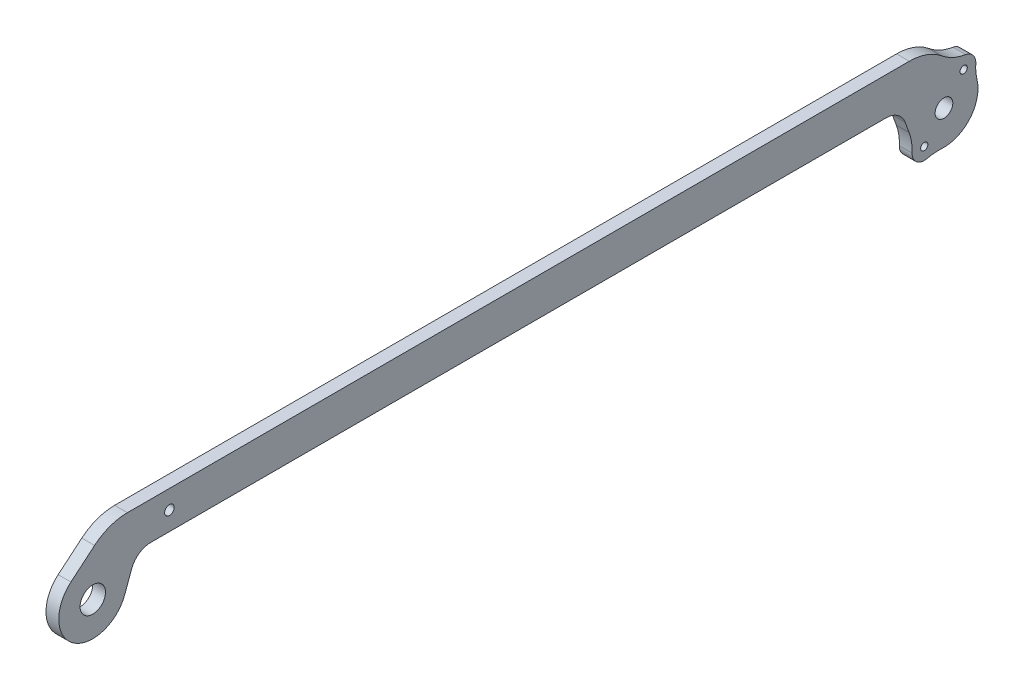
from build123d import *

# Parameters (mm, degrees)
SKETCH1_R           = 4.7371
SKETCH1_R_2         = 3.302
BOSS_EXTRUDE1_DEPTH = 4.7625
BOSS_EXTRUDE2_START = -4.7625
BOSS_EXTRUDE2_DEPTH = 4.7625
SKETCH2_3_R         = 1.35255
CUT_EXTRUDE3_DEPTH  = 331.93934415
FILLET1_R           = 19.05
SKETCH3_R           = 1.778
CUT_EXTRUDE4_DEPTH  = 331.939344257


with BuildPart() as part:
    # Sketch1 → Boss-Extrude1 (new body)
    with BuildSketch(Plane(origin=(0, 0, 0), x_dir=(0, 0, -1), z_dir=(1, 0, 0))):
        with BuildLine():
            Line((-8.163402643, 9.728764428), (5.972267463, 21.59))
            Line((5.972267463, 21.59), (311.527732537, 21.59))
            Line((311.527732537, 21.59), (325.663402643, 9.728764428))
            ThreePointArc((325.663402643, 9.728764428), (324.784420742, -10.403230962), (305.565903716, -4.34365582))
            Line((305.565903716, -4.34365582), (303.036365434, 2.606193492))
            ThreePointArc((303.036365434, 2.606193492), (300.246560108, 6.241938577), (295.875907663, 7.62))
            Line((295.875907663, 7.62), (21.624092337, 7.62))
            ThreePointArc((21.624092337, 7.62), (17.253439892, 6.241938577), (14.463634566, 2.606193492))
            Line((14.463634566, 2.606193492), (11.934096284, -4.34365582))
            ThreePointArc((11.934096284, -4.34365582), (-7.284420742, -10.403230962), (-8.163402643, 9.728764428))
        make_face()
        with Locations(Location((0, 0, 0), (0, 0, 180))):
            Circle(SKETCH1_R, mode=Mode.SUBTRACT)
        with Locations(Location((317.5, 0, 0), (0, 0, 180))):
            Circle(SKETCH1_R_2, mode=Mode.SUBTRACT)
    extrude(amount=BOSS_EXTRUDE1_DEPTH)

    # Sketch2 → Boss-Extrude2 (add)
    with BuildSketch(Plane(origin=(4.7625, 0, 0), x_dir=(0, 0, -1), z_dir=(1, 0, 0)).offset(BOSS_EXTRUDE2_START)):
        with BuildLine():
            ThreePointArc((325.663402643, 9.728764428), (325.849735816, 9.569321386), (326.032955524, 9.406310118))
            ThreePointArc((326.032955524, 9.406310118), (325.726689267, 9.783335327), (325.306972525, 10.027844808))
            Line((325.306972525, 10.027844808), (325.663402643, 9.728764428))
        make_face()
        with BuildLine():
            ThreePointArc((326.199612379, 8.755887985), (326.157285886, 9.091604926), (326.032955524, 9.406310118))
            ThreePointArc((326.032955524, 9.406310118), (325.849735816, 9.569321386), (325.663402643, 9.728764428))
            Line((325.663402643, 9.728764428), (325.306972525, 10.027844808))
            ThreePointArc((325.306972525, 10.027844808), (323.739939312, 7.978925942), (326.199612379, 8.755887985))
        make_face()
        with BuildLine():
            ThreePointArc((326.032955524, 9.406310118), (328.431268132, 6.465089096), (329.853453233, 2.946556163))
            ThreePointArc((329.853453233, 2.946556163), (329.406661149, 5.69994622), (329.366743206, 8.489065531))
            ThreePointArc((329.366743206, 8.489065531), (328.38794879, 11.5773827), (325.596151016, 13.221039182))
            ThreePointArc((325.596151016, 13.221039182), (320.768988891, 14.709996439), (316.502892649, 17.415344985))
            Line((316.502892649, 17.415344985), (325.306972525, 10.027844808))
            ThreePointArc((325.306972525, 10.027844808), (325.726689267, 9.783335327), (326.032955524, 9.406310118))
        make_face()
        with BuildLine():
            ThreePointArc((325.663402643, 9.728764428), (325.849735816, 9.569321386), (326.032955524, 9.406310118))
            ThreePointArc((326.032955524, 9.406310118), (325.726689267, 9.783335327), (325.306972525, 10.027844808))
            Line((325.306972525, 10.027844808), (325.663402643, 9.728764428))
        make_face()
        with BuildLine():
            ThreePointArc((326.199612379, 8.755887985), (326.157285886, 9.091604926), (326.032955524, 9.406310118))
            ThreePointArc((326.032955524, 9.406310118), (325.849735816, 9.569321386), (325.663402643, 9.728764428))
            Line((325.663402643, 9.728764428), (325.306972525, 10.027844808))
            ThreePointArc((325.306972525, 10.027844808), (323.739939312, 7.978925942), (326.199612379, 8.755887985))
        make_face()
        with BuildLine():
            Line((323.823811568, 4.345483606), (329.853453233, 2.946556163))
            ThreePointArc((329.853453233, 2.946556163), (328.431268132, 6.465089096), (326.032955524, 9.406310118))
            ThreePointArc((326.032955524, 9.406310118), (326.157285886, 9.091604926), (326.199612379, 8.755887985))
            ThreePointArc((326.199612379, 8.755887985), (323.739939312, 7.978925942), (325.306972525, 10.027844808))
            Line((325.306972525, 10.027844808), (316.502892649, 17.415344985))
            Line((316.502892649, 17.415344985), (320.643907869, 7.072973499))
            ThreePointArc((320.643907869, 7.072973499), (321.899414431, 5.319308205), (323.823811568, 4.345483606))
        make_face()
        with BuildLine():
            ThreePointArc((309.718325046, -10.036709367), (309.336597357, -9.728764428), (308.967044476, -9.406310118))
            ThreePointArc((308.967044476, -9.406310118), (309.28353524, -9.792001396), (309.718325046, -10.036709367))
        make_face()
        with BuildLine():
            ThreePointArc((311.505487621, -8.755887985), (309.81722068, -7.445664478), (308.967044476, -9.406310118))
            ThreePointArc((308.967044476, -9.406310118), (309.336597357, -9.728764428), (309.718325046, -10.036709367))
            ThreePointArc((309.718325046, -10.036709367), (310.940832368, -9.855257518), (311.505487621, -8.755887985))
        make_face()
        with BuildLine():
            Line((305.565903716, -4.34365582), (304.491782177, -1.392531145))
            ThreePointArc((304.491782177, -1.392531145), (305.407680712, -4.937931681), (305.628316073, -8.593072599))
            ThreePointArc((305.628316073, -8.593072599), (307.282758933, -12.257428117), (311.200540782, -13.160571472))
            ThreePointArc((311.200540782, -13.160571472), (313.954218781, -12.715557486), (316.743363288, -12.677440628))
            ThreePointArc((316.743363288, -12.677440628), (313.031324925, -11.887848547), (309.718325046, -10.036709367))
            ThreePointArc((309.718325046, -10.036709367), (309.28353524, -9.792001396), (308.967044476, -9.406310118))
            ThreePointArc((308.967044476, -9.406310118), (306.958051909, -7.082184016), (305.565903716, -4.34365582))
        make_face()
        with BuildLine():
            Line((311.941766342, -4.596705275), (304.491782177, -1.392531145))
            Line((304.491782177, -1.392531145), (305.565903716, -4.34365582))
            ThreePointArc((305.565903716, -4.34365582), (306.958051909, -7.082184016), (308.967044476, -9.406310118))
            ThreePointArc((308.967044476, -9.406310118), (309.81722068, -7.445664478), (311.505487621, -8.755887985))
            ThreePointArc((311.505487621, -8.755887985), (310.940832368, -9.855257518), (309.718325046, -10.036709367))
            ThreePointArc((309.718325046, -10.036709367), (313.031324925, -11.887848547), (316.743363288, -12.677440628))
            Line((316.743363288, -12.677440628), (314.318652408, -6.98232397))
            ThreePointArc((314.318652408, -6.98232397), (313.360263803, -5.560302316), (311.941766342, -4.596705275))
        make_face()
    extrude(amount=BOSS_EXTRUDE2_DEPTH)

    # Sketch2_3 → Cut-Extrude3 (cut, through all)
    with BuildSketch(Plane(origin=(4.7625, 0, 0), x_dir=(0, 0, -1), z_dir=(1, 0, 0))):
        with Locations((310.152937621, -8.755887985)):
            Circle(SKETCH2_3_R)
        with Locations((324.847062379, 8.755887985)):
            Circle(SKETCH2_3_R)
        with BuildLine():
            ThreePointArc((325.663402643, 9.728764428), (325.849735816, 9.569321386), (326.032955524, 9.406310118))
            ThreePointArc((326.032955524, 9.406310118), (325.726689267, 9.783335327), (325.306972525, 10.027844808))
            Line((325.306972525, 10.027844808), (325.663402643, 9.728764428))
        make_face()
        with BuildLine():
            ThreePointArc((326.199612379, 8.755887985), (326.157285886, 9.091604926), (326.032955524, 9.406310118))
            ThreePointArc((326.032955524, 9.406310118), (325.849735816, 9.569321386), (325.663402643, 9.728764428))
            Line((325.663402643, 9.728764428), (325.306972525, 10.027844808))
            ThreePointArc((325.306972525, 10.027844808), (323.739939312, 7.978925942), (326.199612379, 8.755887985))
        make_face()
        with BuildLine():
            ThreePointArc((308.967044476, -9.406310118), (309.28353524, -9.792001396), (309.718325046, -10.036709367))
            ThreePointArc((309.718325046, -10.036709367), (309.336597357, -9.728764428), (308.967044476, -9.406310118))
        make_face()
        with BuildLine():
            ThreePointArc((308.967044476, -9.406310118), (309.336597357, -9.728764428), (309.718325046, -10.036709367))
            ThreePointArc((309.718325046, -10.036709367), (310.940832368, -9.855257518), (311.505487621, -8.755887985))
            ThreePointArc((311.505487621, -8.755887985), (309.81722068, -7.445664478), (308.967044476, -9.406310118))
        make_face()
    extrude(amount=-CUT_EXTRUDE3_DEPTH, mode=Mode.SUBTRACT)

    # Fillet1
    fillet1_edges = [part.edges().sort_by_distance(p)[0] for p in [
        (2.38125, 21.59, -5.972267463),
        (2.38125, 21.59, -311.527732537),
    ]]
    fillet(fillet1_edges, radius=FILLET1_R)

    # Sketch3 → Cut-Extrude4 (cut, through all)
    with BuildSketch(Plane(origin=(4.7625, 0, 0), x_dir=(0, 0, -1), z_dir=(1, 0, 0))):
        with Locations((28.575, 14.605)):
            Circle(SKETCH3_R)
    extrude(amount=-CUT_EXTRUDE4_DEPTH, mode=Mode.SUBTRACT)


solid = part.part
